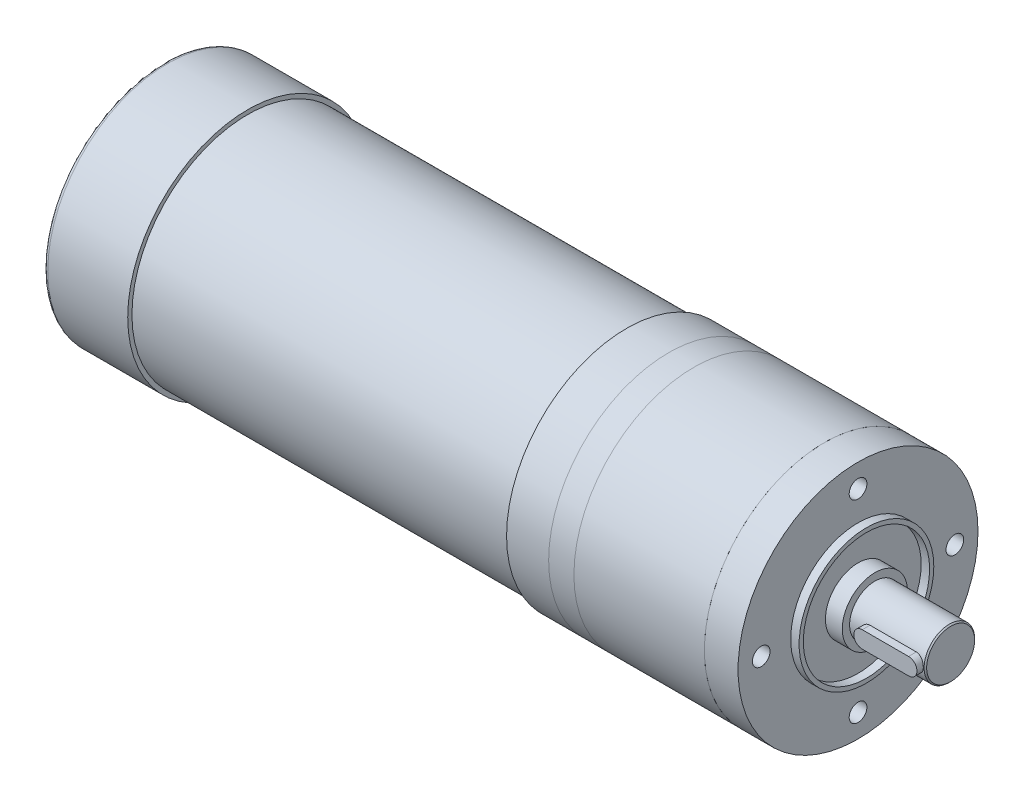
ISO-10303-21;
HEADER;
FILE_DESCRIPTION(('STEP AP214'),'2;1');
FILE_NAME('part.step','',(''),(''),'','','');
FILE_SCHEMA(('AUTOMOTIVE_DESIGN { 1 0 10303 214 1 1 1 1 }'));
ENDSEC;
DATA;
#1=APPLICATION_CONTEXT('core data for automotive mechanical design processes');
#2=APPLICATION_PROTOCOL_DEFINITION('international standard','automotive_design',2000,#1);
#3=PRODUCT_CONTEXT('',#1,'mechanical');
#4=PRODUCT('Part','Part','',(#3));
#5=PRODUCT_RELATED_PRODUCT_CATEGORY('part','',(#4));
#6=PRODUCT_DEFINITION_FORMATION('','',#4);
#7=PRODUCT_DEFINITION_CONTEXT('part definition',#1,'design');
#8=PRODUCT_DEFINITION('design','',#6,#7);
#9=PRODUCT_DEFINITION_SHAPE('','',#8);
#10=(LENGTH_UNIT() NAMED_UNIT(*) SI_UNIT(.MILLI.,.METRE.));
#11=(NAMED_UNIT(*) PLANE_ANGLE_UNIT() SI_UNIT($,.RADIAN.));
#12=(NAMED_UNIT(*) SI_UNIT($,.STERADIAN.) SOLID_ANGLE_UNIT());
#13=UNCERTAINTY_MEASURE_WITH_UNIT(LENGTH_MEASURE(1.E-05),#10,'distance_accuracy_value','');
#14=(GEOMETRIC_REPRESENTATION_CONTEXT(3) GLOBAL_UNCERTAINTY_ASSIGNED_CONTEXT((#13)) GLOBAL_UNIT_ASSIGNED_CONTEXT((#10,
#11,#12)) REPRESENTATION_CONTEXT('',''));
#15=CARTESIAN_POINT('',(0.,0.,0.));
#16=DIRECTION('',(0.,0.,1.));
#17=DIRECTION('',(1.,0.,0.));
#18=AXIS2_PLACEMENT_3D('',#15,#16,#17);
#19=CARTESIAN_POINT('',(8.5,0.,7.5));
#20=DIRECTION('',(0.,0.,-1.));
#21=DIRECTION('',(-1.,0.,0.));
#22=AXIS2_PLACEMENT_3D('',#19,#20,#21);
#23=CYLINDRICAL_SURFACE('',#22,2.);
#24=CARTESIAN_POINT('',(8.5,0.,3.5));
#25=DIRECTION('',(0.,0.,1.));
#26=DIRECTION('',(1.,0.,0.));
#27=AXIS2_PLACEMENT_3D('',#24,#25,#26);
#28=CIRCLE('',#27,2.);
#29=CARTESIAN_POINT('',(8.5,2.,3.5));
#30=VERTEX_POINT('',#29);
#31=CARTESIAN_POINT('',(8.5,-2.,3.5));
#32=VERTEX_POINT('',#31);
#33=EDGE_CURVE('E111',#30,#32,#28,.T.);
#34=ORIENTED_EDGE('',*,*,#33,.T.);
#35=DIRECTION('',(0.,0.,-1.));
#36=VECTOR('',#35,1.);
#37=CARTESIAN_POINT('',(8.5,-2.,7.5));
#38=LINE('',#37,#36);
#39=CARTESIAN_POINT('',(8.5,-2.,7.5));
#40=VERTEX_POINT('',#39);
#41=EDGE_CURVE('E12',#40,#32,#38,.T.);
#42=ORIENTED_EDGE('',*,*,#41,.F.);
#43=CARTESIAN_POINT('',(8.5,0.,7.5));
#44=DIRECTION('',(0.,0.,1.));
#45=DIRECTION('',(1.,0.,0.));
#46=AXIS2_PLACEMENT_3D('',#43,#44,#45);
#47=CIRCLE('',#46,2.);
#48=CARTESIAN_POINT('',(8.5,2.,7.5));
#49=VERTEX_POINT('',#48);
#50=EDGE_CURVE('E99',#49,#40,#47,.T.);
#51=ORIENTED_EDGE('',*,*,#50,.F.);
#52=DIRECTION('',(0.,0.,-1.));
#53=VECTOR('',#52,1.);
#54=CARTESIAN_POINT('',(8.5,2.,7.5));
#55=LINE('',#54,#53);
#56=EDGE_CURVE('E107',#49,#30,#55,.T.);
#57=ORIENTED_EDGE('',*,*,#56,.T.);
#58=EDGE_LOOP('',(#34,#42,#51,#57));
#59=FACE_BOUND('',#58,.T.);
#60=ADVANCED_FACE('F48',(#59),#23,.T.);
#61=CARTESIAN_POINT('',(19.5,-2.,7.5));
#62=DIRECTION('',(0.,1.,0.));
#63=DIRECTION('',(-1.,0.,0.));
#64=AXIS2_PLACEMENT_3D('',#61,#62,#63);
#65=PLANE('',#64);
#66=DIRECTION('',(1.,0.,0.));
#67=VECTOR('',#66,1.);
#68=CARTESIAN_POINT('',(19.5,-2.,3.5));
#69=LINE('',#68,#67);
#70=CARTESIAN_POINT('',(19.5,-2.,3.5));
#71=VERTEX_POINT('',#70);
#72=EDGE_CURVE('E103',#32,#71,#69,.T.);
#73=ORIENTED_EDGE('',*,*,#72,.T.);
#74=DIRECTION('',(0.,0.,-1.));
#75=VECTOR('',#74,1.);
#76=CARTESIAN_POINT('',(19.5,-2.,7.5));
#77=LINE('',#76,#75);
#78=CARTESIAN_POINT('',(19.5,-2.,7.5));
#79=VERTEX_POINT('',#78);
#80=EDGE_CURVE('E56',#79,#71,#77,.T.);
#81=ORIENTED_EDGE('',*,*,#80,.F.);
#82=DIRECTION('',(1.,0.,0.));
#83=VECTOR('',#82,1.);
#84=CARTESIAN_POINT('',(19.5,-2.,7.5));
#85=LINE('',#84,#83);
#86=EDGE_CURVE('E94',#40,#79,#85,.T.);
#87=ORIENTED_EDGE('',*,*,#86,.F.);
#88=ORIENTED_EDGE('',*,*,#41,.T.);
#89=EDGE_LOOP('',(#73,#81,#87,#88));
#90=FACE_BOUND('',#89,.T.);
#91=ADVANCED_FACE('F102',(#90),#65,.F.);
#92=CARTESIAN_POINT('',(19.5,0.,7.5));
#93=DIRECTION('',(0.,0.,-1.));
#94=DIRECTION('',(-1.,0.,0.));
#95=AXIS2_PLACEMENT_3D('',#92,#93,#94);
#96=CYLINDRICAL_SURFACE('',#95,2.);
#97=CARTESIAN_POINT('',(19.5,0.,3.5));
#98=DIRECTION('',(0.,0.,1.));
#99=DIRECTION('',(1.,0.,0.));
#100=AXIS2_PLACEMENT_3D('',#97,#98,#99);
#101=CIRCLE('',#100,2.);
#102=CARTESIAN_POINT('',(19.5,2.,3.5));
#103=VERTEX_POINT('',#102);
#104=EDGE_CURVE('E81',#71,#103,#101,.T.);
#105=ORIENTED_EDGE('',*,*,#104,.T.);
#106=DIRECTION('',(0.,0.,-1.));
#107=VECTOR('',#106,1.);
#108=CARTESIAN_POINT('',(19.5,2.,7.5));
#109=LINE('',#108,#107);
#110=CARTESIAN_POINT('',(19.5,2.,7.5));
#111=VERTEX_POINT('',#110);
#112=EDGE_CURVE('E104',#111,#103,#109,.T.);
#113=ORIENTED_EDGE('',*,*,#112,.F.);
#114=CARTESIAN_POINT('',(19.5,0.,7.5));
#115=DIRECTION('',(0.,0.,1.));
#116=DIRECTION('',(1.,0.,0.));
#117=AXIS2_PLACEMENT_3D('',#114,#115,#116);
#118=CIRCLE('',#117,2.);
#119=EDGE_CURVE('E97',#79,#111,#118,.T.);
#120=ORIENTED_EDGE('',*,*,#119,.F.);
#121=ORIENTED_EDGE('',*,*,#80,.T.);
#122=EDGE_LOOP('',(#105,#113,#120,#121));
#123=FACE_BOUND('',#122,.T.);
#124=ADVANCED_FACE('F105',(#123),#96,.T.);
#125=CARTESIAN_POINT('',(8.5,2.,7.5));
#126=DIRECTION('',(0.,-1.,0.));
#127=DIRECTION('',(1.,0.,0.));
#128=AXIS2_PLACEMENT_3D('',#125,#126,#127);
#129=PLANE('',#128);
#130=DIRECTION('',(-1.,0.,0.));
#131=VECTOR('',#130,1.);
#132=CARTESIAN_POINT('',(8.5,2.,3.5));
#133=LINE('',#132,#131);
#134=EDGE_CURVE('E87',#103,#30,#133,.T.);
#135=ORIENTED_EDGE('',*,*,#134,.T.);
#136=ORIENTED_EDGE('',*,*,#56,.F.);
#137=DIRECTION('',(-1.,0.,0.));
#138=VECTOR('',#137,1.);
#139=CARTESIAN_POINT('',(8.5,2.,7.5));
#140=LINE('',#139,#138);
#141=EDGE_CURVE('E64',#111,#49,#140,.T.);
#142=ORIENTED_EDGE('',*,*,#141,.F.);
#143=ORIENTED_EDGE('',*,*,#112,.T.);
#144=EDGE_LOOP('',(#135,#136,#142,#143));
#145=FACE_BOUND('',#144,.T.);
#146=ADVANCED_FACE('F118',(#145),#129,.F.);
#147=CARTESIAN_POINT('',(8.5,0.,7.5));
#148=DIRECTION('',(0.,0.,1.));
#149=DIRECTION('',(1.,0.,0.));
#150=AXIS2_PLACEMENT_3D('',#147,#148,#149);
#151=PLANE('',#150);
#152=ORIENTED_EDGE('',*,*,#50,.T.);
#153=ORIENTED_EDGE('',*,*,#86,.T.);
#154=ORIENTED_EDGE('',*,*,#119,.T.);
#155=ORIENTED_EDGE('',*,*,#141,.T.);
#156=EDGE_LOOP('',(#152,#153,#154,#155));
#157=FACE_BOUND('',#156,.T.);
#158=ADVANCED_FACE('F95',(#157),#151,.T.);
#159=CARTESIAN_POINT('',(8.5,0.,3.5));
#160=DIRECTION('',(0.,0.,1.));
#161=DIRECTION('',(1.,0.,0.));
#162=AXIS2_PLACEMENT_3D('',#159,#160,#161);
#163=PLANE('',#162);
#164=ORIENTED_EDGE('',*,*,#33,.F.);
#165=ORIENTED_EDGE('',*,*,#134,.F.);
#166=ORIENTED_EDGE('',*,*,#104,.F.);
#167=ORIENTED_EDGE('',*,*,#72,.F.);
#168=EDGE_LOOP('',(#164,#165,#166,#167));
#169=FACE_BOUND('',#168,.T.);
#170=ADVANCED_FACE('F121',(#169),#163,.F.);
#171=CLOSED_SHELL('',(#60,#91,#124,#146,#158,#170));
#172=MANIFOLD_SOLID_BREP('B2',#171);
#173=CARTESIAN_POINT('',(-55.,0.,0.));
#174=DIRECTION('',(-1.,0.,0.));
#175=DIRECTION('',(0.,0.,1.));
#176=AXIS2_PLACEMENT_3D('',#173,#174,#175);
#177=PLANE('',#176);
#178=CARTESIAN_POINT('',(-55.,0.,0.));
#179=DIRECTION('',(-1.,0.,0.));
#180=DIRECTION('',(0.,0.,1.));
#181=AXIS2_PLACEMENT_3D('',#178,#179,#180);
#182=CIRCLE('',#181,28.5);
#183=CARTESIAN_POINT('',(-55.,0.,28.5));
#184=VERTEX_POINT('',#183);
#185=EDGE_CURVE('E191',#184,#184,#182,.T.);
#186=ORIENTED_EDGE('',*,*,#185,.T.);
#187=EDGE_LOOP('',(#186));
#188=FACE_BOUND('',#187,.T.);
#189=CARTESIAN_POINT('',(-55.,0.,0.));
#190=DIRECTION('',(-1.,0.,0.));
#191=DIRECTION('',(0.,0.,1.));
#192=AXIS2_PLACEMENT_3D('',#189,#190,#191);
#193=CIRCLE('',#192,27.5);
#194=CARTESIAN_POINT('',(-55.,0.,-27.5));
#195=VERTEX_POINT('',#194);
#196=EDGE_CURVE('E201',#195,#195,#193,.T.);
#197=ORIENTED_EDGE('',*,*,#196,.F.);
#198=EDGE_LOOP('',(#197));
#199=FACE_BOUND('',#198,.T.);
#200=ADVANCED_FACE('F180',(#188,#199),#177,.T.);
#201=CARTESIAN_POINT('',(-55.,0.,0.));
#202=DIRECTION('',(1.,0.,0.));
#203=DIRECTION('',(0.,0.,-1.));
#204=AXIS2_PLACEMENT_3D('',#201,#202,#203);
#205=CYLINDRICAL_SURFACE('',#204,28.5);
#206=ORIENTED_EDGE('',*,*,#185,.F.);
#207=EDGE_LOOP('',(#206));
#208=FACE_BOUND('',#207,.T.);
#209=CARTESIAN_POINT('',(-45.,0.,0.));
#210=DIRECTION('',(-1.,0.,0.));
#211=DIRECTION('',(0.,0.,1.));
#212=AXIS2_PLACEMENT_3D('',#209,#210,#211);
#213=CIRCLE('',#212,28.5);
#214=CARTESIAN_POINT('',(-45.,0.,28.5));
#215=VERTEX_POINT('',#214);
#216=EDGE_CURVE('E195',#215,#215,#213,.T.);
#217=ORIENTED_EDGE('',*,*,#216,.T.);
#218=EDGE_LOOP('',(#217));
#219=FACE_BOUND('',#218,.T.);
#220=ADVANCED_FACE('F226',(#208,#219),#205,.T.);
#221=CARTESIAN_POINT('',(-45.,0.,0.));
#222=DIRECTION('',(-1.,0.,0.));
#223=DIRECTION('',(0.,0.,1.));
#224=AXIS2_PLACEMENT_3D('',#221,#222,#223);
#225=PLANE('',#224);
#226=ORIENTED_EDGE('',*,*,#216,.F.);
#227=EDGE_LOOP('',(#226));
#228=FACE_BOUND('',#227,.T.);
#229=ADVANCED_FACE('F221',(#228),#225,.F.);
#230=CARTESIAN_POINT('',(-145.,0.,0.));
#231=DIRECTION('',(1.,0.,0.));
#232=DIRECTION('',(0.,0.,-1.));
#233=AXIS2_PLACEMENT_3D('',#230,#231,#232);
#234=CYLINDRICAL_SURFACE('',#233,27.5);
#235=CARTESIAN_POINT('',(-145.,0.,0.));
#236=DIRECTION('',(-1.,0.,0.));
#237=DIRECTION('',(0.,0.,1.));
#238=AXIS2_PLACEMENT_3D('',#235,#236,#237);
#239=CIRCLE('',#238,27.5);
#240=CARTESIAN_POINT('',(-145.,0.,-27.5));
#241=VERTEX_POINT('',#240);
#242=EDGE_CURVE('E199',#241,#241,#239,.T.);
#243=CARTESIAN_POINT('',(-145.,0.,-27.5));
#244=CARTESIAN_POINT('',(-144.0625,0.,-27.5));
#245=CARTESIAN_POINT('',(-143.125,0.,-27.5));
#246=CARTESIAN_POINT('',(-141.25,0.,-27.5));
#247=CARTESIAN_POINT('',(-140.3125,0.,-27.5));
#248=CARTESIAN_POINT('',(-138.4375,0.,-27.5));
#249=CARTESIAN_POINT('',(-137.5,0.,-27.5));
#250=CARTESIAN_POINT('',(-135.625,0.,-27.5));
#251=CARTESIAN_POINT('',(-134.6875,0.,-27.5));
#252=CARTESIAN_POINT('',(-132.8125,0.,-27.5));
#253=CARTESIAN_POINT('',(-131.875,0.,-27.5));
#254=CARTESIAN_POINT('',(-130.,0.,-27.5));
#255=CARTESIAN_POINT('',(-129.0625,0.,-27.5));
#256=CARTESIAN_POINT('',(-127.1875,0.,-27.5));
#257=CARTESIAN_POINT('',(-126.25,0.,-27.5));
#258=CARTESIAN_POINT('',(-124.375,0.,-27.5));
#259=CARTESIAN_POINT('',(-123.4375,0.,-27.5));
#260=CARTESIAN_POINT('',(-121.5625,0.,-27.5));
#261=CARTESIAN_POINT('',(-120.625,0.,-27.5));
#262=CARTESIAN_POINT('',(-118.75,0.,-27.5));
#263=CARTESIAN_POINT('',(-117.8125,0.,-27.5));
#264=CARTESIAN_POINT('',(-115.9375,0.,-27.5));
#265=CARTESIAN_POINT('',(-115.,0.,-27.5));
#266=CARTESIAN_POINT('',(-113.125,0.,-27.5));
#267=CARTESIAN_POINT('',(-112.1875,0.,-27.5));
#268=CARTESIAN_POINT('',(-110.3125,0.,-27.5));
#269=CARTESIAN_POINT('',(-109.375,0.,-27.5));
#270=CARTESIAN_POINT('',(-107.5,0.,-27.5));
#271=CARTESIAN_POINT('',(-106.5625,0.,-27.5));
#272=CARTESIAN_POINT('',(-104.6875,0.,-27.5));
#273=CARTESIAN_POINT('',(-103.75,0.,-27.5));
#274=CARTESIAN_POINT('',(-101.875,0.,-27.5));
#275=CARTESIAN_POINT('',(-100.9375,0.,-27.5));
#276=CARTESIAN_POINT('',(-99.0625,0.,-27.5));
#277=CARTESIAN_POINT('',(-98.125,0.,-27.5));
#278=CARTESIAN_POINT('',(-96.25,0.,-27.5));
#279=CARTESIAN_POINT('',(-95.3125,0.,-27.5));
#280=CARTESIAN_POINT('',(-93.4375,0.,-27.5));
#281=CARTESIAN_POINT('',(-92.5,0.,-27.5));
#282=CARTESIAN_POINT('',(-90.625,0.,-27.5));
#283=CARTESIAN_POINT('',(-89.6875,0.,-27.5));
#284=CARTESIAN_POINT('',(-87.8125,0.,-27.5));
#285=CARTESIAN_POINT('',(-86.875,0.,-27.5));
#286=CARTESIAN_POINT('',(-85.,0.,-27.5));
#287=CARTESIAN_POINT('',(-84.0625,0.,-27.5));
#288=CARTESIAN_POINT('',(-82.1875,0.,-27.5));
#289=CARTESIAN_POINT('',(-81.25,0.,-27.5));
#290=CARTESIAN_POINT('',(-79.375,0.,-27.5));
#291=CARTESIAN_POINT('',(-78.4375,0.,-27.5));
#292=CARTESIAN_POINT('',(-76.5625,0.,-27.5));
#293=CARTESIAN_POINT('',(-75.625,0.,-27.5));
#294=CARTESIAN_POINT('',(-73.75,0.,-27.5));
#295=CARTESIAN_POINT('',(-72.8125,0.,-27.5));
#296=CARTESIAN_POINT('',(-70.9375,0.,-27.5));
#297=CARTESIAN_POINT('',(-70.,0.,-27.5));
#298=CARTESIAN_POINT('',(-68.125,0.,-27.5));
#299=CARTESIAN_POINT('',(-67.1875,0.,-27.5));
#300=CARTESIAN_POINT('',(-65.3125,0.,-27.5));
#301=CARTESIAN_POINT('',(-64.375,0.,-27.5));
#302=CARTESIAN_POINT('',(-62.5,0.,-27.5));
#303=CARTESIAN_POINT('',(-61.5625,0.,-27.5));
#304=CARTESIAN_POINT('',(-59.6875,0.,-27.5));
#305=CARTESIAN_POINT('',(-58.75,0.,-27.5));
#306=CARTESIAN_POINT('',(-56.875,0.,-27.5));
#307=CARTESIAN_POINT('',(-55.9375,0.,-27.5));
#308=CARTESIAN_POINT('',(-55.,0.,-27.5));
#309=B_SPLINE_CURVE_WITH_KNOTS('',3,(#243,#244,#245,#246,#247,#248,#249,#250,#251,#252,#253,
#254,#255,#256,#257,#258,#259,#260,#261,#262,#263,#264,#265,#266,#267,#268,#269,#270,#271,#272,
#273,#274,#275,#276,#277,#278,#279,#280,#281,#282,#283,#284,#285,#286,#287,#288,#289,#290,#291,
#292,#293,#294,#295,#296,#297,#298,#299,#300,#301,#302,#303,#304,#305,#306,#307,#308),
.UNSPECIFIED.,.F.,.F.,(4,2,2,2,2,2,2,2,2,2,2,2,2,2,2,2,2,2,2,2,2,2,2,2,2,2,2,2,2,2,2,2,4),(0.,
2.8125,5.62499999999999,8.43749999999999,11.25,14.0625,16.875,19.6875,22.5,25.3125,28.125,
30.9375,33.75,36.5625,39.375,42.1875,45.,47.8125,50.625,53.4375,56.25,59.0625,61.875,64.6875,
67.5,70.3125,73.125,75.9375,78.75,81.5625,84.3749999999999,87.1875,90.),.UNSPECIFIED.);
#310=EDGE_CURVE('BSEAM215',#241,#195,#309,.T.);
#311=ORIENTED_EDGE('',*,*,#242,.F.);
#312=ORIENTED_EDGE('',*,*,#196,.T.);
#313=ORIENTED_EDGE('',*,*,#310,.T.);
#314=ORIENTED_EDGE('',*,*,#310,.F.);
#315=EDGE_LOOP('',(#311,#313,#312,#314));
#316=FACE_BOUND('',#315,.T.);
#317=ADVANCED_FACE('F215',(#316),#234,.T.);
#318=CARTESIAN_POINT('',(-145.,0.,0.));
#319=DIRECTION('',(-1.,0.,0.));
#320=DIRECTION('',(0.,0.,1.));
#321=AXIS2_PLACEMENT_3D('',#318,#319,#320);
#322=PLANE('',#321);
#323=CARTESIAN_POINT('',(-145.,0.,0.));
#324=DIRECTION('',(-1.,0.,0.));
#325=DIRECTION('',(0.,0.,1.));
#326=AXIS2_PLACEMENT_3D('',#323,#324,#325);
#327=CIRCLE('',#326,28.5);
#328=CARTESIAN_POINT('',(-145.,0.,28.5));
#329=VERTEX_POINT('',#328);
#330=EDGE_CURVE('E204',#329,#329,#327,.T.);
#331=ORIENTED_EDGE('',*,*,#330,.F.);
#332=EDGE_LOOP('',(#331));
#333=FACE_BOUND('',#332,.T.);
#334=ORIENTED_EDGE('',*,*,#242,.T.);
#335=EDGE_LOOP('',(#334));
#336=FACE_BOUND('',#335,.T.);
#337=ADVANCED_FACE('F212',(#333,#336),#322,.F.);
#338=CARTESIAN_POINT('',(-165.,0.,0.));
#339=DIRECTION('',(1.,0.,0.));
#340=DIRECTION('',(0.,0.,-1.));
#341=AXIS2_PLACEMENT_3D('',#338,#339,#340);
#342=CYLINDRICAL_SURFACE('',#341,28.5);
#343=CARTESIAN_POINT('',(-164.,0.,0.));
#344=DIRECTION('',(-1.,0.,0.));
#345=DIRECTION('',(0.,0.,1.));
#346=AXIS2_PLACEMENT_3D('',#343,#344,#345);
#347=CIRCLE('',#346,28.5);
#348=CARTESIAN_POINT('',(-164.,0.,28.5));
#349=VERTEX_POINT('',#348);
#350=EDGE_CURVE('E47',#349,#349,#347,.F.);
#351=ORIENTED_EDGE('',*,*,#350,.T.);
#352=EDGE_LOOP('',(#351));
#353=FACE_BOUND('',#352,.T.);
#354=ORIENTED_EDGE('',*,*,#330,.T.);
#355=EDGE_LOOP('',(#354));
#356=FACE_BOUND('',#355,.T.);
#357=ADVANCED_FACE('F210',(#353,#356),#342,.T.);
#358=CARTESIAN_POINT('',(-165.,0.,0.));
#359=DIRECTION('',(-1.,0.,0.));
#360=DIRECTION('',(0.,0.,1.));
#361=AXIS2_PLACEMENT_3D('',#358,#359,#360);
#362=PLANE('',#361);
#363=CARTESIAN_POINT('',(-165.,0.,0.));
#364=DIRECTION('',(-1.,0.,0.));
#365=DIRECTION('',(0.,0.,1.));
#366=AXIS2_PLACEMENT_3D('',#363,#364,#365);
#367=CIRCLE('',#366,27.5);
#368=CARTESIAN_POINT('',(-165.,0.,27.5));
#369=VERTEX_POINT('',#368);
#370=EDGE_CURVE('E187',#369,#369,#367,.T.);
#371=ORIENTED_EDGE('',*,*,#370,.T.);
#372=EDGE_LOOP('',(#371));
#373=FACE_BOUND('',#372,.T.);
#374=ADVANCED_FACE('F257',(#373),#362,.T.);
#375=CARTESIAN_POINT('',(-164.,0.,0.));
#376=DIRECTION('',(-1.,0.,0.));
#377=DIRECTION('',(0.,0.,1.));
#378=AXIS2_PLACEMENT_3D('',#375,#376,#377);
#379=TOROIDAL_SURFACE('',#378,27.5,1.);
#380=ORIENTED_EDGE('',*,*,#350,.F.);
#381=EDGE_LOOP('',(#380));
#382=FACE_BOUND('',#381,.T.);
#383=ORIENTED_EDGE('',*,*,#370,.F.);
#384=EDGE_LOOP('',(#383));
#385=FACE_BOUND('',#384,.T.);
#386=ADVANCED_FACE('F182',(#382,#385),#379,.T.);
#387=CLOSED_SHELL('',(#200,#220,#229,#317,#337,#357,#374,#386));
#388=MANIFOLD_SOLID_BREP('B6',#387);
#389=CARTESIAN_POINT('',(-45.,0.,0.));
#390=DIRECTION('',(1.,0.,0.));
#391=DIRECTION('',(0.,0.,-1.));
#392=AXIS2_PLACEMENT_3D('',#389,#390,#391);
#393=CYLINDRICAL_SURFACE('',#392,28.5);
#394=CARTESIAN_POINT('',(-45.,0.,0.));
#395=DIRECTION('',(-1.,0.,0.));
#396=DIRECTION('',(0.,0.,1.));
#397=AXIS2_PLACEMENT_3D('',#394,#395,#396);
#398=CIRCLE('',#397,28.5);
#399=CARTESIAN_POINT('',(-45.,0.,28.5));
#400=VERTEX_POINT('',#399);
#401=EDGE_CURVE('E179',#400,#400,#398,.T.);
#402=ORIENTED_EDGE('',*,*,#401,.F.);
#403=EDGE_LOOP('',(#402));
#404=FACE_BOUND('',#403,.T.);
#405=CARTESIAN_POINT('',(-39.,0.,0.));
#406=DIRECTION('',(-1.,0.,0.));
#407=DIRECTION('',(0.,0.,1.));
#408=AXIS2_PLACEMENT_3D('',#405,#406,#407);
#409=CIRCLE('',#408,28.5);
#410=CARTESIAN_POINT('',(-39.,0.,28.5));
#411=VERTEX_POINT('',#410);
#412=EDGE_CURVE('E309',#411,#411,#409,.T.);
#413=ORIENTED_EDGE('',*,*,#412,.T.);
#414=EDGE_LOOP('',(#413));
#415=FACE_BOUND('',#414,.T.);
#416=ADVANCED_FACE('F306',(#404,#415),#393,.T.);
#417=CARTESIAN_POINT('',(-45.,0.,0.));
#418=DIRECTION('',(-1.,0.,0.));
#419=DIRECTION('',(0.,0.,1.));
#420=AXIS2_PLACEMENT_3D('',#417,#418,#419);
#421=PLANE('',#420);
#422=ORIENTED_EDGE('',*,*,#401,.T.);
#423=EDGE_LOOP('',(#422));
#424=FACE_BOUND('',#423,.T.);
#425=ADVANCED_FACE('F321',(#424),#421,.T.);
#426=CARTESIAN_POINT('',(-39.,0.,0.));
#427=DIRECTION('',(-1.,0.,0.));
#428=DIRECTION('',(0.,0.,1.));
#429=AXIS2_PLACEMENT_3D('',#426,#427,#428);
#430=PLANE('',#429);
#431=ORIENTED_EDGE('',*,*,#412,.F.);
#432=EDGE_LOOP('',(#431));
#433=FACE_BOUND('',#432,.T.);
#434=ADVANCED_FACE('F319',(#433),#430,.F.);
#435=CLOSED_SHELL('',(#416,#425,#434));
#436=MANIFOLD_SOLID_BREP('B42',#435);
#437=CARTESIAN_POINT('',(-39.,0.,0.));
#438=DIRECTION('',(1.,0.,0.));
#439=DIRECTION('',(0.,0.,-1.));
#440=AXIS2_PLACEMENT_3D('',#437,#438,#439);
#441=CYLINDRICAL_SURFACE('',#440,28.5);
#442=CARTESIAN_POINT('',(-39.,0.,0.));
#443=DIRECTION('',(-1.,0.,0.));
#444=DIRECTION('',(0.,0.,1.));
#445=AXIS2_PLACEMENT_3D('',#442,#443,#444);
#446=CIRCLE('',#445,28.5);
#447=CARTESIAN_POINT('',(-39.,0.,28.5));
#448=VERTEX_POINT('',#447);
#449=EDGE_CURVE('E304',#448,#448,#446,.T.);
#450=ORIENTED_EDGE('',*,*,#449,.F.);
#451=EDGE_LOOP('',(#450));
#452=FACE_BOUND('',#451,.T.);
#453=CARTESIAN_POINT('',(-8.,0.,0.));
#454=DIRECTION('',(-1.,0.,0.));
#455=DIRECTION('',(0.,0.,1.));
#456=AXIS2_PLACEMENT_3D('',#453,#454,#455);
#457=CIRCLE('',#456,28.5);
#458=CARTESIAN_POINT('',(-8.,0.,28.5));
#459=VERTEX_POINT('',#458);
#460=EDGE_CURVE('E364',#459,#459,#457,.T.);
#461=ORIENTED_EDGE('',*,*,#460,.T.);
#462=EDGE_LOOP('',(#461));
#463=FACE_BOUND('',#462,.T.);
#464=ADVANCED_FACE('F356',(#452,#463),#441,.T.);
#465=CARTESIAN_POINT('',(-39.,0.,0.));
#466=DIRECTION('',(-1.,0.,0.));
#467=DIRECTION('',(0.,0.,1.));
#468=AXIS2_PLACEMENT_3D('',#465,#466,#467);
#469=PLANE('',#468);
#470=ORIENTED_EDGE('',*,*,#449,.T.);
#471=EDGE_LOOP('',(#470));
#472=FACE_BOUND('',#471,.T.);
#473=ADVANCED_FACE('F429',(#472),#469,.T.);
#474=CARTESIAN_POINT('',(-8.,0.,0.));
#475=DIRECTION('',(-1.,0.,0.));
#476=DIRECTION('',(0.,0.,1.));
#477=AXIS2_PLACEMENT_3D('',#474,#475,#476);
#478=PLANE('',#477);
#479=CARTESIAN_POINT('',(-8.,23.,0.));
#480=DIRECTION('',(-1.,0.,0.));
#481=DIRECTION('',(0.,0.,1.));
#482=AXIS2_PLACEMENT_3D('',#479,#480,#481);
#483=CIRCLE('',#482,2.1);
#484=CARTESIAN_POINT('',(-8.,23.,2.1));
#485=VERTEX_POINT('',#484);
#486=EDGE_CURVE('E359',#485,#485,#483,.T.);
#487=ORIENTED_EDGE('',*,*,#486,.T.);
#488=EDGE_LOOP('',(#487));
#489=FACE_BOUND('',#488,.T.);
#490=CARTESIAN_POINT('',(-8.,0.,-23.));
#491=DIRECTION('',(-1.,0.,0.));
#492=DIRECTION('',(0.,0.,1.));
#493=AXIS2_PLACEMENT_3D('',#490,#491,#492);
#494=CIRCLE('',#493,2.1);
#495=CARTESIAN_POINT('',(-8.,0.,-20.9));
#496=VERTEX_POINT('',#495);
#497=EDGE_CURVE('E393',#496,#496,#494,.T.);
#498=ORIENTED_EDGE('',*,*,#497,.T.);
#499=EDGE_LOOP('',(#498));
#500=FACE_BOUND('',#499,.T.);
#501=CARTESIAN_POINT('',(-8.,-23.,0.));
#502=DIRECTION('',(-1.,0.,0.));
#503=DIRECTION('',(0.,0.,1.));
#504=AXIS2_PLACEMENT_3D('',#501,#502,#503);
#505=CIRCLE('',#504,2.1);
#506=CARTESIAN_POINT('',(-8.,-23.,2.1));
#507=VERTEX_POINT('',#506);
#508=EDGE_CURVE('E397',#507,#507,#505,.T.);
#509=ORIENTED_EDGE('',*,*,#508,.T.);
#510=EDGE_LOOP('',(#509));
#511=FACE_BOUND('',#510,.T.);
#512=CARTESIAN_POINT('',(-8.,0.,23.));
#513=DIRECTION('',(-1.,0.,0.));
#514=DIRECTION('',(0.,0.,1.));
#515=AXIS2_PLACEMENT_3D('',#512,#513,#514);
#516=CIRCLE('',#515,2.1);
#517=CARTESIAN_POINT('',(-8.,0.,25.1));
#518=VERTEX_POINT('',#517);
#519=EDGE_CURVE('E400',#518,#518,#516,.T.);
#520=ORIENTED_EDGE('',*,*,#519,.T.);
#521=EDGE_LOOP('',(#520));
#522=FACE_BOUND('',#521,.T.);
#523=ORIENTED_EDGE('',*,*,#460,.F.);
#524=EDGE_LOOP('',(#523));
#525=FACE_BOUND('',#524,.T.);
#526=ADVANCED_FACE('F410',(#489,#500,#511,#522,#525),#478,.F.);
#527=CARTESIAN_POINT('',(0.,0.,23.));
#528=DIRECTION('',(1.,0.,0.));
#529=DIRECTION('',(0.,0.,-1.));
#530=AXIS2_PLACEMENT_3D('',#527,#528,#529);
#531=CYLINDRICAL_SURFACE('',#530,2.1);
#532=CARTESIAN_POINT('',(-14.,0.,23.));
#533=DIRECTION('',(1.,0.,0.));
#534=DIRECTION('',(0.,0.,-1.));
#535=AXIS2_PLACEMENT_3D('',#532,#533,#534);
#536=CIRCLE('',#535,2.1);
#537=CARTESIAN_POINT('',(-14.,0.,20.9));
#538=VERTEX_POINT('',#537);
#539=EDGE_CURVE('E398',#538,#538,#536,.T.);
#540=ORIENTED_EDGE('',*,*,#539,.F.);
#541=EDGE_LOOP('',(#540));
#542=FACE_BOUND('',#541,.T.);
#543=ORIENTED_EDGE('',*,*,#519,.F.);
#544=EDGE_LOOP('',(#543));
#545=FACE_BOUND('',#544,.T.);
#546=ADVANCED_FACE('F441',(#542,#545),#531,.F.);
#547=CARTESIAN_POINT('',(-14.,0.,23.));
#548=DIRECTION('',(1.,0.,0.));
#549=DIRECTION('',(0.,0.,-1.));
#550=AXIS2_PLACEMENT_3D('',#547,#548,#549);
#551=CONICAL_SURFACE('',#550,2.1,1.02974425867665);
#552=CARTESIAN_POINT('',(-15.2618072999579,0.,23.));
#553=VERTEX_POINT('',#552);
#554=VERTEX_LOOP('',#553);
#555=FACE_BOUND('',#554,.T.);
#556=ORIENTED_EDGE('',*,*,#539,.T.);
#557=EDGE_LOOP('',(#556));
#558=FACE_BOUND('',#557,.T.);
#559=ADVANCED_FACE('F446',(#555,#558),#551,.F.);
#560=CARTESIAN_POINT('',(0.,-23.,0.));
#561=DIRECTION('',(1.,0.,0.));
#562=DIRECTION('',(0.,0.,-1.));
#563=AXIS2_PLACEMENT_3D('',#560,#561,#562);
#564=CYLINDRICAL_SURFACE('',#563,2.1);
#565=CARTESIAN_POINT('',(-14.,-23.,0.));
#566=DIRECTION('',(1.,0.,0.));
#567=DIRECTION('',(0.,0.,-1.));
#568=AXIS2_PLACEMENT_3D('',#565,#566,#567);
#569=CIRCLE('',#568,2.1);
#570=CARTESIAN_POINT('',(-14.,-23.,-2.1));
#571=VERTEX_POINT('',#570);
#572=EDGE_CURVE('E394',#571,#571,#569,.T.);
#573=ORIENTED_EDGE('',*,*,#572,.F.);
#574=EDGE_LOOP('',(#573));
#575=FACE_BOUND('',#574,.T.);
#576=ORIENTED_EDGE('',*,*,#508,.F.);
#577=EDGE_LOOP('',(#576));
#578=FACE_BOUND('',#577,.T.);
#579=ADVANCED_FACE('F425',(#575,#578),#564,.F.);
#580=CARTESIAN_POINT('',(-14.,-23.,0.));
#581=DIRECTION('',(1.,0.,0.));
#582=DIRECTION('',(0.,0.,-1.));
#583=AXIS2_PLACEMENT_3D('',#580,#581,#582);
#584=CONICAL_SURFACE('',#583,2.1,1.02974425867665);
#585=CARTESIAN_POINT('',(-15.2618072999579,-23.,0.));
#586=VERTEX_POINT('',#585);
#587=VERTEX_LOOP('',#586);
#588=FACE_BOUND('',#587,.T.);
#589=ORIENTED_EDGE('',*,*,#572,.T.);
#590=EDGE_LOOP('',(#589));
#591=FACE_BOUND('',#590,.T.);
#592=ADVANCED_FACE('F416',(#588,#591),#584,.F.);
#593=CARTESIAN_POINT('',(0.,0.,-23.));
#594=DIRECTION('',(1.,0.,0.));
#595=DIRECTION('',(0.,0.,-1.));
#596=AXIS2_PLACEMENT_3D('',#593,#594,#595);
#597=CYLINDRICAL_SURFACE('',#596,2.1);
#598=CARTESIAN_POINT('',(-14.,0.,-23.));
#599=DIRECTION('',(1.,0.,0.));
#600=DIRECTION('',(0.,0.,-1.));
#601=AXIS2_PLACEMENT_3D('',#598,#599,#600);
#602=CIRCLE('',#601,2.1);
#603=CARTESIAN_POINT('',(-14.,0.,-25.1));
#604=VERTEX_POINT('',#603);
#605=EDGE_CURVE('E389',#604,#604,#602,.T.);
#606=ORIENTED_EDGE('',*,*,#605,.F.);
#607=EDGE_LOOP('',(#606));
#608=FACE_BOUND('',#607,.T.);
#609=ORIENTED_EDGE('',*,*,#497,.F.);
#610=EDGE_LOOP('',(#609));
#611=FACE_BOUND('',#610,.T.);
#612=ADVANCED_FACE('F413',(#608,#611),#597,.F.);
#613=CARTESIAN_POINT('',(-14.,0.,-23.));
#614=DIRECTION('',(1.,0.,0.));
#615=DIRECTION('',(0.,0.,-1.));
#616=AXIS2_PLACEMENT_3D('',#613,#614,#615);
#617=CONICAL_SURFACE('',#616,2.1,1.02974425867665);
#618=CARTESIAN_POINT('',(-15.2618072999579,0.,-23.));
#619=VERTEX_POINT('',#618);
#620=VERTEX_LOOP('',#619);
#621=FACE_BOUND('',#620,.T.);
#622=ORIENTED_EDGE('',*,*,#605,.T.);
#623=EDGE_LOOP('',(#622));
#624=FACE_BOUND('',#623,.T.);
#625=ADVANCED_FACE('F415',(#621,#624),#617,.F.);
#626=CARTESIAN_POINT('',(0.,23.,0.));
#627=DIRECTION('',(1.,0.,0.));
#628=DIRECTION('',(0.,0.,-1.));
#629=AXIS2_PLACEMENT_3D('',#626,#627,#628);
#630=CYLINDRICAL_SURFACE('',#629,2.1);
#631=CARTESIAN_POINT('',(-14.,23.,0.));
#632=DIRECTION('',(1.,0.,0.));
#633=DIRECTION('',(0.,0.,-1.));
#634=AXIS2_PLACEMENT_3D('',#631,#632,#633);
#635=CIRCLE('',#634,2.1);
#636=CARTESIAN_POINT('',(-14.,23.,-2.1));
#637=VERTEX_POINT('',#636);
#638=EDGE_CURVE('E385',#637,#637,#635,.T.);
#639=ORIENTED_EDGE('',*,*,#638,.F.);
#640=EDGE_LOOP('',(#639));
#641=FACE_BOUND('',#640,.T.);
#642=ORIENTED_EDGE('',*,*,#486,.F.);
#643=EDGE_LOOP('',(#642));
#644=FACE_BOUND('',#643,.T.);
#645=ADVANCED_FACE('F381',(#641,#644),#630,.F.);
#646=CARTESIAN_POINT('',(-14.,23.,0.));
#647=DIRECTION('',(1.,0.,0.));
#648=DIRECTION('',(0.,0.,-1.));
#649=AXIS2_PLACEMENT_3D('',#646,#647,#648);
#650=CONICAL_SURFACE('',#649,2.1,1.02974425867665);
#651=CARTESIAN_POINT('',(-15.2618072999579,23.,0.));
#652=VERTEX_POINT('',#651);
#653=VERTEX_LOOP('',#652);
#654=FACE_BOUND('',#653,.T.);
#655=ORIENTED_EDGE('',*,*,#638,.T.);
#656=EDGE_LOOP('',(#655));
#657=FACE_BOUND('',#656,.T.);
#658=ADVANCED_FACE('F378',(#654,#657),#650,.F.);
#659=CLOSED_SHELL('',(#464,#473,#526,#546,#559,#579,#592,#612,#625,#645,#658));
#660=MANIFOLD_SOLID_BREP('B174',#659);
#661=CARTESIAN_POINT('',(4.,0.,0.));
#662=DIRECTION('',(1.,0.,0.));
#663=DIRECTION('',(0.,0.,-1.));
#664=AXIS2_PLACEMENT_3D('',#661,#662,#663);
#665=PLANE('',#664);
#666=CARTESIAN_POINT('',(4.,0.,0.));
#667=DIRECTION('',(1.,0.,0.));
#668=DIRECTION('',(0.,0.,-1.));
#669=AXIS2_PLACEMENT_3D('',#666,#667,#668);
#670=CIRCLE('',#669,7.75);
#671=CARTESIAN_POINT('',(4.,0.,-7.75));
#672=VERTEX_POINT('',#671);
#673=EDGE_CURVE('E642',#672,#672,#670,.T.);
#674=ORIENTED_EDGE('',*,*,#673,.T.);
#675=EDGE_LOOP('',(#674));
#676=FACE_BOUND('',#675,.T.);
#677=CARTESIAN_POINT('',(4.,0.,0.));
#678=DIRECTION('',(1.,0.,0.));
#679=DIRECTION('',(0.,0.,-1.));
#680=AXIS2_PLACEMENT_3D('',#677,#678,#679);
#681=CIRCLE('',#680,6.);
#682=CARTESIAN_POINT('',(4.,0.,-6.));
#683=VERTEX_POINT('',#682);
#684=EDGE_CURVE('E638',#683,#683,#681,.T.);
#685=ORIENTED_EDGE('',*,*,#684,.F.);
#686=EDGE_LOOP('',(#685));
#687=FACE_BOUND('',#686,.T.);
#688=ADVANCED_FACE('F547',(#676,#687),#665,.T.);
#689=CARTESIAN_POINT('',(0.,0.,0.));
#690=DIRECTION('',(1.,0.,0.));
#691=DIRECTION('',(0.,0.,-1.));
#692=AXIS2_PLACEMENT_3D('',#689,#690,#691);
#693=PLANE('',#692);
#694=CARTESIAN_POINT('',(0.,0.,0.));
#695=DIRECTION('',(1.,0.,0.));
#696=DIRECTION('',(0.,0.,-1.));
#697=AXIS2_PLACEMENT_3D('',#694,#695,#696);
#698=CIRCLE('',#697,15.);
#699=CARTESIAN_POINT('',(0.,0.,-15.));
#700=VERTEX_POINT('',#699);
#701=EDGE_CURVE('E660',#700,#700,#698,.F.);
#702=ORIENTED_EDGE('',*,*,#701,.F.);
#703=EDGE_LOOP('',(#702));
#704=FACE_BOUND('',#703,.T.);
#705=CARTESIAN_POINT('',(0.,0.,0.));
#706=DIRECTION('',(1.,0.,0.));
#707=DIRECTION('',(0.,0.,-1.));
#708=AXIS2_PLACEMENT_3D('',#705,#706,#707);
#709=CIRCLE('',#708,7.75);
#710=CARTESIAN_POINT('',(0.,0.,-7.75));
#711=VERTEX_POINT('',#710);
#712=EDGE_CURVE('E641',#711,#711,#709,.T.);
#713=ORIENTED_EDGE('',*,*,#712,.F.);
#714=EDGE_LOOP('',(#713));
#715=FACE_BOUND('',#714,.T.);
#716=ADVANCED_FACE('F723',(#704,#715),#693,.T.);
#717=CARTESIAN_POINT('',(0.,23.,0.));
#718=DIRECTION('',(1.,0.,0.));
#719=DIRECTION('',(0.,0.,-1.));
#720=AXIS2_PLACEMENT_3D('',#717,#718,#719);
#721=CIRCLE('',#720,2.1);
#722=CARTESIAN_POINT('',(0.,23.,-2.1));
#723=VERTEX_POINT('',#722);
#724=EDGE_CURVE('E615',#723,#723,#721,.T.);
#725=ORIENTED_EDGE('',*,*,#724,.F.);
#726=EDGE_LOOP('',(#725));
#727=FACE_BOUND('',#726,.T.);
#728=CARTESIAN_POINT('',(0.,0.,-23.));
#729=DIRECTION('',(1.,0.,0.));
#730=DIRECTION('',(0.,0.,-1.));
#731=AXIS2_PLACEMENT_3D('',#728,#729,#730);
#732=CIRCLE('',#731,2.1);
#733=CARTESIAN_POINT('',(0.,0.,-25.1));
#734=VERTEX_POINT('',#733);
#735=EDGE_CURVE('E622',#734,#734,#732,.T.);
#736=ORIENTED_EDGE('',*,*,#735,.F.);
#737=EDGE_LOOP('',(#736));
#738=FACE_BOUND('',#737,.T.);
#739=CARTESIAN_POINT('',(0.,-23.,0.));
#740=DIRECTION('',(1.,0.,0.));
#741=DIRECTION('',(0.,0.,-1.));
#742=AXIS2_PLACEMENT_3D('',#739,#740,#741);
#743=CIRCLE('',#742,2.1);
#744=CARTESIAN_POINT('',(0.,-23.,-2.1));
#745=VERTEX_POINT('',#744);
#746=EDGE_CURVE('E628',#745,#745,#743,.T.);
#747=ORIENTED_EDGE('',*,*,#746,.F.);
#748=EDGE_LOOP('',(#747));
#749=FACE_BOUND('',#748,.T.);
#750=CARTESIAN_POINT('',(0.,0.,23.));
#751=DIRECTION('',(1.,0.,0.));
#752=DIRECTION('',(0.,0.,-1.));
#753=AXIS2_PLACEMENT_3D('',#750,#751,#752);
#754=CIRCLE('',#753,2.1);
#755=CARTESIAN_POINT('',(0.,0.,20.9));
#756=VERTEX_POINT('',#755);
#757=EDGE_CURVE('E632',#756,#756,#754,.T.);
#758=ORIENTED_EDGE('',*,*,#757,.F.);
#759=EDGE_LOOP('',(#758));
#760=FACE_BOUND('',#759,.T.);
#761=CARTESIAN_POINT('',(0.,0.,0.));
#762=DIRECTION('',(1.,0.,0.));
#763=DIRECTION('',(0.,0.,-1.));
#764=AXIS2_PLACEMENT_3D('',#761,#762,#763);
#765=CIRCLE('',#764,28.5);
#766=CARTESIAN_POINT('',(0.,0.,-28.5));
#767=VERTEX_POINT('',#766);
#768=EDGE_CURVE('E654',#767,#767,#765,.T.);
#769=ORIENTED_EDGE('',*,*,#768,.T.);
#770=EDGE_LOOP('',(#769));
#771=FACE_BOUND('',#770,.T.);
#772=CARTESIAN_POINT('',(0.,0.,0.));
#773=DIRECTION('',(1.,0.,0.));
#774=DIRECTION('',(0.,0.,-1.));
#775=AXIS2_PLACEMENT_3D('',#772,#773,#774);
#776=CIRCLE('',#775,16.);
#777=CARTESIAN_POINT('',(0.,0.,-16.));
#778=VERTEX_POINT('',#777);
#779=EDGE_CURVE('E650',#778,#778,#776,.T.);
#780=ORIENTED_EDGE('',*,*,#779,.F.);
#781=EDGE_LOOP('',(#780));
#782=FACE_BOUND('',#781,.T.);
#783=ADVANCED_FACE('F728',(#727,#738,#749,#760,#771,#782),#693,.T.);
#784=CARTESIAN_POINT('',(-8.,0.,0.));
#785=DIRECTION('',(1.,0.,0.));
#786=DIRECTION('',(0.,0.,-1.));
#787=AXIS2_PLACEMENT_3D('',#784,#785,#786);
#788=CYLINDRICAL_SURFACE('',#787,28.5);
#789=CARTESIAN_POINT('',(-8.,0.,0.));
#790=DIRECTION('',(1.,0.,0.));
#791=DIRECTION('',(0.,0.,-1.));
#792=AXIS2_PLACEMENT_3D('',#789,#790,#791);
#793=CIRCLE('',#792,28.5);
#794=CARTESIAN_POINT('',(-8.,0.,-28.5));
#795=VERTEX_POINT('',#794);
#796=EDGE_CURVE('E657',#795,#795,#793,.T.);
#797=ORIENTED_EDGE('',*,*,#796,.T.);
#798=EDGE_LOOP('',(#797));
#799=FACE_BOUND('',#798,.T.);
#800=ORIENTED_EDGE('',*,*,#768,.F.);
#801=EDGE_LOOP('',(#800));
#802=FACE_BOUND('',#801,.T.);
#803=ADVANCED_FACE('F750',(#799,#802),#788,.T.);
#804=CARTESIAN_POINT('',(-8.,0.,0.));
#805=DIRECTION('',(1.,0.,0.));
#806=DIRECTION('',(0.,0.,-1.));
#807=AXIS2_PLACEMENT_3D('',#804,#805,#806);
#808=PLANE('',#807);
#809=CARTESIAN_POINT('',(-8.,23.,0.));
#810=DIRECTION('',(1.,0.,0.));
#811=DIRECTION('',(0.,0.,-1.));
#812=AXIS2_PLACEMENT_3D('',#809,#810,#811);
#813=CIRCLE('',#812,2.1);
#814=CARTESIAN_POINT('',(-8.,23.,-2.1));
#815=VERTEX_POINT('',#814);
#816=EDGE_CURVE('E621',#815,#815,#813,.T.);
#817=ORIENTED_EDGE('',*,*,#816,.T.);
#818=EDGE_LOOP('',(#817));
#819=FACE_BOUND('',#818,.T.);
#820=CARTESIAN_POINT('',(-8.,0.,-23.));
#821=DIRECTION('',(1.,0.,0.));
#822=DIRECTION('',(0.,0.,-1.));
#823=AXIS2_PLACEMENT_3D('',#820,#821,#822);
#824=CIRCLE('',#823,2.1);
#825=CARTESIAN_POINT('',(-8.,0.,-25.1));
#826=VERTEX_POINT('',#825);
#827=EDGE_CURVE('E625',#826,#826,#824,.T.);
#828=ORIENTED_EDGE('',*,*,#827,.T.);
#829=EDGE_LOOP('',(#828));
#830=FACE_BOUND('',#829,.T.);
#831=CARTESIAN_POINT('',(-8.,-23.,0.));
#832=DIRECTION('',(1.,0.,0.));
#833=DIRECTION('',(0.,0.,-1.));
#834=AXIS2_PLACEMENT_3D('',#831,#832,#833);
#835=CIRCLE('',#834,2.1);
#836=CARTESIAN_POINT('',(-8.,-23.,-2.1));
#837=VERTEX_POINT('',#836);
#838=EDGE_CURVE('E631',#837,#837,#835,.T.);
#839=ORIENTED_EDGE('',*,*,#838,.T.);
#840=EDGE_LOOP('',(#839));
#841=FACE_BOUND('',#840,.T.);
#842=CARTESIAN_POINT('',(-8.,0.,23.));
#843=DIRECTION('',(1.,0.,0.));
#844=DIRECTION('',(0.,0.,-1.));
#845=AXIS2_PLACEMENT_3D('',#842,#843,#844);
#846=CIRCLE('',#845,2.1);
#847=CARTESIAN_POINT('',(-8.,0.,20.9));
#848=VERTEX_POINT('',#847);
#849=EDGE_CURVE('E635',#848,#848,#846,.T.);
#850=ORIENTED_EDGE('',*,*,#849,.T.);
#851=EDGE_LOOP('',(#850));
#852=FACE_BOUND('',#851,.T.);
#853=ORIENTED_EDGE('',*,*,#796,.F.);
#854=EDGE_LOOP('',(#853));
#855=FACE_BOUND('',#854,.T.);
#856=ADVANCED_FACE('F744',(#819,#830,#841,#852,#855),#808,.F.);
#857=CARTESIAN_POINT('',(2.,0.,0.));
#858=DIRECTION('',(1.,0.,0.));
#859=DIRECTION('',(0.,0.,-1.));
#860=AXIS2_PLACEMENT_3D('',#857,#858,#859);
#861=PLANE('',#860);
#862=CARTESIAN_POINT('',(2.,0.,0.));
#863=DIRECTION('',(1.,0.,0.));
#864=DIRECTION('',(0.,0.,-1.));
#865=AXIS2_PLACEMENT_3D('',#862,#863,#864);
#866=CIRCLE('',#865,16.);
#867=CARTESIAN_POINT('',(2.,0.,-16.));
#868=VERTEX_POINT('',#867);
#869=EDGE_CURVE('E651',#868,#868,#866,.T.);
#870=ORIENTED_EDGE('',*,*,#869,.T.);
#871=EDGE_LOOP('',(#870));
#872=FACE_BOUND('',#871,.T.);
#873=CARTESIAN_POINT('',(2.,0.,0.));
#874=DIRECTION('',(1.,0.,0.));
#875=DIRECTION('',(0.,0.,-1.));
#876=AXIS2_PLACEMENT_3D('',#873,#874,#875);
#877=CIRCLE('',#876,15.);
#878=CARTESIAN_POINT('',(2.,0.,-15.));
#879=VERTEX_POINT('',#878);
#880=EDGE_CURVE('E645',#879,#879,#877,.T.);
#881=ORIENTED_EDGE('',*,*,#880,.F.);
#882=EDGE_LOOP('',(#881));
#883=FACE_BOUND('',#882,.T.);
#884=ADVANCED_FACE('F741',(#872,#883),#861,.T.);
#885=CARTESIAN_POINT('',(2.,0.,0.));
#886=DIRECTION('',(-1.,0.,0.));
#887=DIRECTION('',(0.,0.,1.));
#888=AXIS2_PLACEMENT_3D('',#885,#886,#887);
#889=CYLINDRICAL_SURFACE('',#888,16.);
#890=ORIENTED_EDGE('',*,*,#869,.F.);
#891=EDGE_LOOP('',(#890));
#892=FACE_BOUND('',#891,.T.);
#893=ORIENTED_EDGE('',*,*,#779,.T.);
#894=EDGE_LOOP('',(#893));
#895=FACE_BOUND('',#894,.T.);
#896=ADVANCED_FACE('F739',(#892,#895),#889,.T.);
#897=CARTESIAN_POINT('',(2.,0.,0.));
#898=DIRECTION('',(-1.,0.,0.));
#899=DIRECTION('',(0.,0.,1.));
#900=AXIS2_PLACEMENT_3D('',#897,#898,#899);
#901=CYLINDRICAL_SURFACE('',#900,15.);
#902=ORIENTED_EDGE('',*,*,#880,.T.);
#903=EDGE_LOOP('',(#902));
#904=FACE_BOUND('',#903,.T.);
#905=ORIENTED_EDGE('',*,*,#701,.T.);
#906=EDGE_LOOP('',(#905));
#907=FACE_BOUND('',#906,.T.);
#908=ADVANCED_FACE('F735',(#904,#907),#901,.F.);
#909=CARTESIAN_POINT('',(4.,0.,0.));
#910=DIRECTION('',(-1.,0.,0.));
#911=DIRECTION('',(0.,0.,1.));
#912=AXIS2_PLACEMENT_3D('',#909,#910,#911);
#913=CYLINDRICAL_SURFACE('',#912,7.75);
#914=ORIENTED_EDGE('',*,*,#673,.F.);
#915=EDGE_LOOP('',(#914));
#916=FACE_BOUND('',#915,.T.);
#917=ORIENTED_EDGE('',*,*,#712,.T.);
#918=EDGE_LOOP('',(#917));
#919=FACE_BOUND('',#918,.T.);
#920=ADVANCED_FACE('F719',(#916,#919),#913,.T.);
#921=CARTESIAN_POINT('',(22.,0.,0.));
#922=DIRECTION('',(-1.,0.,0.));
#923=DIRECTION('',(0.,0.,1.));
#924=AXIS2_PLACEMENT_3D('',#921,#922,#923);
#925=CYLINDRICAL_SURFACE('',#924,6.);
#926=CARTESIAN_POINT('',(21.7,0.,0.));
#927=DIRECTION('',(1.,0.,0.));
#928=DIRECTION('',(0.,0.,-1.));
#929=AXIS2_PLACEMENT_3D('',#926,#927,#928);
#930=CIRCLE('',#929,6.);
#931=CARTESIAN_POINT('',(21.7,0.,-6.));
#932=VERTEX_POINT('',#931);
#933=EDGE_CURVE('E354',#932,#932,#930,.F.);
#934=ORIENTED_EDGE('',*,*,#933,.T.);
#935=EDGE_LOOP('',(#934));
#936=FACE_BOUND('',#935,.T.);
#937=DIRECTION('',(-1.,0.,0.));
#938=VECTOR('',#937,1.);
#939=CARTESIAN_POINT('',(22.,2.,5.65685424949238));
#940=LINE('',#939,#938);
#941=CARTESIAN_POINT('',(8.5,2.,5.65685424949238));
#942=VERTEX_POINT('',#941);
#943=CARTESIAN_POINT('',(19.5,2.,5.65685424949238));
#944=VERTEX_POINT('',#943);
#945=EDGE_CURVE('E570',#942,#944,#940,.F.);
#946=ORIENTED_EDGE('',*,*,#945,.T.);
#947=CARTESIAN_POINT('',(19.5,2.,5.65685424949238));
#948=CARTESIAN_POINT('',(19.5545809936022,2.00000149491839,5.65684884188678));
#949=CARTESIAN_POINT('',(19.6091341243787,1.99776424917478,5.6576451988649));
#950=CARTESIAN_POINT('',(19.7178171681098,1.9888512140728,5.66078654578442));
#951=CARTESIAN_POINT('',(19.7719471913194,1.98217662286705,5.66313111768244));
#952=CARTESIAN_POINT('',(19.9327842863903,1.95562135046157,5.67238184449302));
#953=CARTESIAN_POINT('',(20.038361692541,1.92920846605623,5.6815058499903));
#954=CARTESIAN_POINT('',(20.2432503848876,1.85991682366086,5.70456149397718));
#955=CARTESIAN_POINT('',(20.3425650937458,1.81704715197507,5.71849047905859));
#956=CARTESIAN_POINT('',(20.5326796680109,1.71614645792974,5.74957574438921));
#957=CARTESIAN_POINT('',(20.6234742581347,1.65810612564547,5.76673400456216));
#958=CARTESIAN_POINT('',(20.7974404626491,1.52610278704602,5.80308960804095));
#959=CARTESIAN_POINT('',(20.8802297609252,1.45164996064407,5.82233755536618));
#960=CARTESIAN_POINT('',(21.0324120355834,1.28997688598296,5.86027697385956));
#961=CARTESIAN_POINT('',(21.1018026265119,1.20275436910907,5.87896834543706));
#962=CARTESIAN_POINT('',(21.2269590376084,1.01520729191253,5.91427765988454));
#963=CARTESIAN_POINT('',(21.2823219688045,0.914600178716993,5.93082875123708));
#964=CARTESIAN_POINT('',(21.3751845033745,0.704858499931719,5.95939217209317));
#965=CARTESIAN_POINT('',(21.4126895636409,0.595726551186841,5.97140588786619));
#966=CARTESIAN_POINT('',(21.4674714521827,0.376058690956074,5.98918142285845));
#967=CARTESIAN_POINT('',(21.4854065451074,0.265703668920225,5.99514617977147));
#968=CARTESIAN_POINT('',(21.5026325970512,0.0433979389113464,6.00087216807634));
#969=CARTESIAN_POINT('',(21.5019279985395,-0.0685523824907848,6.00063487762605));
#970=CARTESIAN_POINT('',(21.4823114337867,-0.286207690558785,5.99412077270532));
#971=CARTESIAN_POINT('',(21.4641147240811,-0.391985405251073,5.98808121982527));
#972=CARTESIAN_POINT('',(21.4112136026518,-0.598888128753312,5.97093921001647));
#973=CARTESIAN_POINT('',(21.3765082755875,-0.700012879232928,5.95983647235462));
#974=CARTESIAN_POINT('',(21.2911572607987,-0.896305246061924,5.93351336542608));
#975=CARTESIAN_POINT('',(21.2403079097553,-0.991377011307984,5.91824075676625));
#976=CARTESIAN_POINT('',(21.1242800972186,-1.17184917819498,5.88516775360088));
#977=CARTESIAN_POINT('',(21.059097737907,-1.25724693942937,5.86736667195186));
#978=CARTESIAN_POINT('',(20.9126579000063,-1.42019467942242,5.83012543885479));
#979=CARTESIAN_POINT('',(20.8307889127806,-1.4971872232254,5.81064757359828));
#980=CARTESIAN_POINT('',(20.6551170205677,-1.63654404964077,5.77294980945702));
#981=CARTESIAN_POINT('',(20.5613102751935,-1.69890360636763,5.75473031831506));
#982=CARTESIAN_POINT('',(20.3626396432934,-1.80800665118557,5.72140062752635));
#983=CARTESIAN_POINT('',(20.2576329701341,-1.85450601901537,5.70634029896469));
#984=CARTESIAN_POINT('',(20.0407060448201,-1.92892046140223,5.68162194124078));
#985=CARTESIAN_POINT('',(19.9287970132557,-1.95686487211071,5.67195538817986));
#986=CARTESIAN_POINT('',(19.763162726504,-1.98331631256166,5.6627308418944));
#987=CARTESIAN_POINT('',(19.7107172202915,-1.98957012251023,5.66053335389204));
#988=CARTESIAN_POINT('',(19.6055238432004,-1.99790923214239,5.65759407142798));
#989=CARTESIAN_POINT('',(19.5527764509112,-1.99999991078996,5.65685039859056));
#990=CARTESIAN_POINT('',(19.5,-2.,5.65685424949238));
#991=B_SPLINE_CURVE_WITH_KNOTS('',3,(#947,#948,#949,#950,#951,#952,#953,#954,#955,#956,#957,
#958,#959,#960,#961,#962,#963,#964,#965,#966,#967,#968,#969,#970,#971,#972,#973,#974,#975,#976,
#977,#978,#979,#980,#981,#982,#983,#984,#985,#986,#987,#988,#989,#990),.UNSPECIFIED.,.F.,.F.,(4,
2,2,2,2,2,2,2,2,2,2,2,2,2,2,2,2,2,2,2,2,4),(0.,0.163636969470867,0.327229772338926,
0.653162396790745,0.978915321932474,1.30486862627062,1.64233009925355,1.97985159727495,
2.32618265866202,2.67240782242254,3.00658941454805,3.34069136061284,3.6616883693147,
3.98270317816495,4.30794037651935,4.63326613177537,4.973881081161,5.31460588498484,
5.6603605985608,6.00556734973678,6.16399790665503,6.32222363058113),.UNSPECIFIED.);
#992=CARTESIAN_POINT('',(19.5,-2.,5.65685424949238));
#993=VERTEX_POINT('',#992);
#994=EDGE_CURVE('E665',#944,#993,#991,.T.);
#995=ORIENTED_EDGE('',*,*,#994,.T.);
#996=DIRECTION('',(-1.,0.,0.));
#997=VECTOR('',#996,1.);
#998=CARTESIAN_POINT('',(22.,-2.,5.65685424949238));
#999=LINE('',#998,#997);
#1000=CARTESIAN_POINT('',(8.5,-2.,5.65685424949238));
#1001=VERTEX_POINT('',#1000);
#1002=EDGE_CURVE('E893',#993,#1001,#999,.T.);
#1003=ORIENTED_EDGE('',*,*,#1002,.T.);
#1004=CARTESIAN_POINT('',(8.5,-2.,5.65685424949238));
#1005=CARTESIAN_POINT('',(8.44541900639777,-2.0000014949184,5.65684884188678));
#1006=CARTESIAN_POINT('',(8.39086587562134,-1.99776424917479,5.6576451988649));
#1007=CARTESIAN_POINT('',(8.28218283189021,-1.9888512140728,5.66078654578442));
#1008=CARTESIAN_POINT('',(8.22805280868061,-1.98217662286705,5.66313111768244));
#1009=CARTESIAN_POINT('',(8.06721571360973,-1.95562135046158,5.67238184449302));
#1010=CARTESIAN_POINT('',(7.96163830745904,-1.92920846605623,5.6815058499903));
#1011=CARTESIAN_POINT('',(7.75674961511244,-1.85991682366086,5.70456149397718));
#1012=CARTESIAN_POINT('',(7.65743490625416,-1.81704715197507,5.71849047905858));
#1013=CARTESIAN_POINT('',(7.46732033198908,-1.71614645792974,5.74957574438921));
#1014=CARTESIAN_POINT('',(7.37652574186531,-1.65810612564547,5.76673400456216));
#1015=CARTESIAN_POINT('',(7.20255953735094,-1.52610278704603,5.80308960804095));
#1016=CARTESIAN_POINT('',(7.11977023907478,-1.45164996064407,5.82233755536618));
#1017=CARTESIAN_POINT('',(6.96758796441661,-1.28997688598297,5.86027697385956));
#1018=CARTESIAN_POINT('',(6.89819737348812,-1.20275436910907,5.87896834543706));
#1019=CARTESIAN_POINT('',(6.7730409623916,-1.01520729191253,5.91427765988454));
#1020=CARTESIAN_POINT('',(6.71767803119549,-0.914600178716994,5.93082875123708));
#1021=CARTESIAN_POINT('',(6.62481549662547,-0.704858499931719,5.95939217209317));
#1022=CARTESIAN_POINT('',(6.58731043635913,-0.595726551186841,5.97140588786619));
#1023=CARTESIAN_POINT('',(6.53252854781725,-0.376058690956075,5.98918142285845));
#1024=CARTESIAN_POINT('',(6.51459345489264,-0.265703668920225,5.99514617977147));
#1025=CARTESIAN_POINT('',(6.49736740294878,-0.0433979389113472,6.00087216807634));
#1026=CARTESIAN_POINT('',(6.4980720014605,0.0685523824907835,6.00063487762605));
#1027=CARTESIAN_POINT('',(6.51768856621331,0.286207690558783,5.99412077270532));
#1028=CARTESIAN_POINT('',(6.53588527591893,0.391985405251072,5.98808121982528));
#1029=CARTESIAN_POINT('',(6.58878639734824,0.598888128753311,5.97093921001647));
#1030=CARTESIAN_POINT('',(6.62349172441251,0.700012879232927,5.95983647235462));
#1031=CARTESIAN_POINT('',(6.70884273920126,0.896305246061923,5.93351336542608));
#1032=CARTESIAN_POINT('',(6.75969209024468,0.991377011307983,5.91824075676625));
#1033=CARTESIAN_POINT('',(6.8757199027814,1.17184917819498,5.88516775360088));
#1034=CARTESIAN_POINT('',(6.94090226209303,1.25724693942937,5.86736667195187));
#1035=CARTESIAN_POINT('',(7.08734209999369,1.42019467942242,5.83012543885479));
#1036=CARTESIAN_POINT('',(7.16921108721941,1.4971872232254,5.81064757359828));
#1037=CARTESIAN_POINT('',(7.34488297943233,1.63654404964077,5.77294980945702));
#1038=CARTESIAN_POINT('',(7.43868972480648,1.69890360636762,5.75473031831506));
#1039=CARTESIAN_POINT('',(7.63736035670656,1.80800665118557,5.72140062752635));
#1040=CARTESIAN_POINT('',(7.74236702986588,1.85450601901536,5.70634029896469));
#1041=CARTESIAN_POINT('',(7.95929395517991,1.92892046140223,5.68162194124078));
#1042=CARTESIAN_POINT('',(8.0712029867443,1.95686487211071,5.67195538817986));
#1043=CARTESIAN_POINT('',(8.23683727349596,1.98331631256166,5.6627308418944));
#1044=CARTESIAN_POINT('',(8.28928277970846,1.98957012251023,5.66053335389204));
#1045=CARTESIAN_POINT('',(8.39447615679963,1.99790923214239,5.65759407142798));
#1046=CARTESIAN_POINT('',(8.44722354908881,1.99999991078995,5.65685039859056));
#1047=CARTESIAN_POINT('',(8.5,2.,5.65685424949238));
#1048=B_SPLINE_CURVE_WITH_KNOTS('',3,(#1004,#1005,#1006,#1007,#1008,#1009,#1010,#1011,#1012,
#1013,#1014,#1015,#1016,#1017,#1018,#1019,#1020,#1021,#1022,#1023,#1024,#1025,#1026,#1027,#1028,
#1029,#1030,#1031,#1032,#1033,#1034,#1035,#1036,#1037,#1038,#1039,#1040,#1041,#1042,#1043,#1044,
#1045,#1046,#1047),.UNSPECIFIED.,.F.,.F.,(4,2,2,2,2,2,2,2,2,2,2,2,2,2,2,2,2,2,2,2,2,4),(0.,
0.163636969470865,0.327229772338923,0.653162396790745,0.978915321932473,1.30486862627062,
1.64233009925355,1.97985159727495,2.32618265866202,2.67240782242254,3.00658941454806,
3.34069136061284,3.6616883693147,3.98270317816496,4.30794037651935,4.63326613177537,
4.973881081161,5.31460588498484,5.6603605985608,6.00556734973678,6.16399790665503,
6.32222363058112),.UNSPECIFIED.);
#1049=EDGE_CURVE('E562',#1001,#942,#1048,.T.);
#1050=ORIENTED_EDGE('',*,*,#1049,.T.);
#1051=EDGE_LOOP('',(#946,#995,#1003,#1050));
#1052=FACE_BOUND('',#1051,.T.);
#1053=ORIENTED_EDGE('',*,*,#684,.T.);
#1054=EDGE_LOOP('',(#1053));
#1055=FACE_BOUND('',#1054,.T.);
#1056=ADVANCED_FACE('F682',(#936,#1052,#1055),#925,.T.);
#1057=CARTESIAN_POINT('',(22.,0.,0.));
#1058=DIRECTION('',(1.,0.,0.));
#1059=DIRECTION('',(0.,0.,-1.));
#1060=AXIS2_PLACEMENT_3D('',#1057,#1058,#1059);
#1061=PLANE('',#1060);
#1062=CARTESIAN_POINT('',(22.,0.,0.));
#1063=DIRECTION('',(1.,0.,0.));
#1064=DIRECTION('',(0.,0.,-1.));
#1065=AXIS2_PLACEMENT_3D('',#1062,#1063,#1064);
#1066=CIRCLE('',#1065,5.7);
#1067=CARTESIAN_POINT('',(22.,0.,-5.7));
#1068=VERTEX_POINT('',#1067);
#1069=EDGE_CURVE('E555',#1068,#1068,#1066,.T.);
#1070=ORIENTED_EDGE('',*,*,#1069,.T.);
#1071=EDGE_LOOP('',(#1070));
#1072=FACE_BOUND('',#1071,.T.);
#1073=ADVANCED_FACE('F712',(#1072),#1061,.T.);
#1074=CARTESIAN_POINT('',(0.,0.,23.));
#1075=DIRECTION('',(1.,0.,0.));
#1076=DIRECTION('',(0.,0.,-1.));
#1077=AXIS2_PLACEMENT_3D('',#1074,#1075,#1076);
#1078=CYLINDRICAL_SURFACE('',#1077,2.1);
#1079=ORIENTED_EDGE('',*,*,#757,.T.);
#1080=EDGE_LOOP('',(#1079));
#1081=FACE_BOUND('',#1080,.T.);
#1082=ORIENTED_EDGE('',*,*,#849,.F.);
#1083=EDGE_LOOP('',(#1082));
#1084=FACE_BOUND('',#1083,.T.);
#1085=ADVANCED_FACE('F709',(#1081,#1084),#1078,.F.);
#1086=CARTESIAN_POINT('',(0.,-23.,0.));
#1087=DIRECTION('',(1.,0.,0.));
#1088=DIRECTION('',(0.,0.,-1.));
#1089=AXIS2_PLACEMENT_3D('',#1086,#1087,#1088);
#1090=CYLINDRICAL_SURFACE('',#1089,2.1);
#1091=ORIENTED_EDGE('',*,*,#746,.T.);
#1092=EDGE_LOOP('',(#1091));
#1093=FACE_BOUND('',#1092,.T.);
#1094=ORIENTED_EDGE('',*,*,#838,.F.);
#1095=EDGE_LOOP('',(#1094));
#1096=FACE_BOUND('',#1095,.T.);
#1097=ADVANCED_FACE('F705',(#1093,#1096),#1090,.F.);
#1098=CARTESIAN_POINT('',(0.,0.,-23.));
#1099=DIRECTION('',(1.,0.,0.));
#1100=DIRECTION('',(0.,0.,-1.));
#1101=AXIS2_PLACEMENT_3D('',#1098,#1099,#1100);
#1102=CYLINDRICAL_SURFACE('',#1101,2.1);
#1103=ORIENTED_EDGE('',*,*,#735,.T.);
#1104=EDGE_LOOP('',(#1103));
#1105=FACE_BOUND('',#1104,.T.);
#1106=ORIENTED_EDGE('',*,*,#827,.F.);
#1107=EDGE_LOOP('',(#1106));
#1108=FACE_BOUND('',#1107,.T.);
#1109=ADVANCED_FACE('F701',(#1105,#1108),#1102,.F.);
#1110=CARTESIAN_POINT('',(0.,23.,0.));
#1111=DIRECTION('',(1.,0.,0.));
#1112=DIRECTION('',(0.,0.,-1.));
#1113=AXIS2_PLACEMENT_3D('',#1110,#1111,#1112);
#1114=CYLINDRICAL_SURFACE('',#1113,2.1);
#1115=ORIENTED_EDGE('',*,*,#724,.T.);
#1116=EDGE_LOOP('',(#1115));
#1117=FACE_BOUND('',#1116,.T.);
#1118=ORIENTED_EDGE('',*,*,#816,.F.);
#1119=EDGE_LOOP('',(#1118));
#1120=FACE_BOUND('',#1119,.T.);
#1121=ADVANCED_FACE('F698',(#1117,#1120),#1114,.F.);
#1122=CARTESIAN_POINT('',(8.5,0.,3.5));
#1123=DIRECTION('',(0.,0.,1.));
#1124=DIRECTION('',(1.,0.,0.));
#1125=AXIS2_PLACEMENT_3D('',#1122,#1123,#1124);
#1126=CYLINDRICAL_SURFACE('',#1125,2.);
#1127=DIRECTION('',(0.,0.,1.));
#1128=VECTOR('',#1127,1.);
#1129=CARTESIAN_POINT('',(8.5,-2.,3.5));
#1130=LINE('',#1129,#1128);
#1131=CARTESIAN_POINT('',(8.5,-2.,3.5));
#1132=VERTEX_POINT('',#1131);
#1133=EDGE_CURVE('E587',#1132,#1001,#1130,.T.);
#1134=ORIENTED_EDGE('',*,*,#1133,.F.);
#1135=CARTESIAN_POINT('',(8.5,0.,3.5));
#1136=DIRECTION('',(0.,0.,1.));
#1137=DIRECTION('',(1.,0.,0.));
#1138=AXIS2_PLACEMENT_3D('',#1135,#1136,#1137);
#1139=CIRCLE('',#1138,2.);
#1140=CARTESIAN_POINT('',(8.5,2.,3.5));
#1141=VERTEX_POINT('',#1140);
#1142=EDGE_CURVE('E591',#1141,#1132,#1139,.T.);
#1143=ORIENTED_EDGE('',*,*,#1142,.F.);
#1144=DIRECTION('',(0.,0.,1.));
#1145=VECTOR('',#1144,1.);
#1146=CARTESIAN_POINT('',(8.5,2.,3.5));
#1147=LINE('',#1146,#1145);
#1148=EDGE_CURVE('E613',#1141,#942,#1147,.T.);
#1149=ORIENTED_EDGE('',*,*,#1148,.T.);
#1150=ORIENTED_EDGE('',*,*,#1049,.F.);
#1151=EDGE_LOOP('',(#1134,#1143,#1149,#1150));
#1152=FACE_BOUND('',#1151,.T.);
#1153=ADVANCED_FACE('F589',(#1152),#1126,.F.);
#1154=CARTESIAN_POINT('',(8.5,2.,3.5));
#1155=DIRECTION('',(0.,1.,0.));
#1156=DIRECTION('',(-1.,0.,0.));
#1157=AXIS2_PLACEMENT_3D('',#1154,#1155,#1156);
#1158=PLANE('',#1157);
#1159=ORIENTED_EDGE('',*,*,#1148,.F.);
#1160=DIRECTION('',(-1.,0.,0.));
#1161=VECTOR('',#1160,1.);
#1162=CARTESIAN_POINT('',(8.5,2.,3.5));
#1163=LINE('',#1162,#1161);
#1164=CARTESIAN_POINT('',(19.5,2.,3.5));
#1165=VERTEX_POINT('',#1164);
#1166=EDGE_CURVE('E596',#1165,#1141,#1163,.T.);
#1167=ORIENTED_EDGE('',*,*,#1166,.F.);
#1168=DIRECTION('',(0.,0.,1.));
#1169=VECTOR('',#1168,1.);
#1170=CARTESIAN_POINT('',(19.5,2.,3.5));
#1171=LINE('',#1170,#1169);
#1172=EDGE_CURVE('E616',#1165,#944,#1171,.T.);
#1173=ORIENTED_EDGE('',*,*,#1172,.T.);
#1174=ORIENTED_EDGE('',*,*,#945,.F.);
#1175=EDGE_LOOP('',(#1159,#1167,#1173,#1174));
#1176=FACE_BOUND('',#1175,.T.);
#1177=ADVANCED_FACE('F691',(#1176),#1158,.F.);
#1178=CARTESIAN_POINT('',(19.5,0.,3.5));
#1179=DIRECTION('',(0.,0.,1.));
#1180=DIRECTION('',(1.,0.,0.));
#1181=AXIS2_PLACEMENT_3D('',#1178,#1179,#1180);
#1182=CYLINDRICAL_SURFACE('',#1181,2.);
#1183=ORIENTED_EDGE('',*,*,#1172,.F.);
#1184=CARTESIAN_POINT('',(19.5,0.,3.5));
#1185=DIRECTION('',(0.,0.,1.));
#1186=DIRECTION('',(1.,0.,0.));
#1187=AXIS2_PLACEMENT_3D('',#1184,#1185,#1186);
#1188=CIRCLE('',#1187,2.);
#1189=CARTESIAN_POINT('',(19.5,-2.,3.5));
#1190=VERTEX_POINT('',#1189);
#1191=EDGE_CURVE('E605',#1190,#1165,#1188,.T.);
#1192=ORIENTED_EDGE('',*,*,#1191,.F.);
#1193=DIRECTION('',(0.,0.,1.));
#1194=VECTOR('',#1193,1.);
#1195=CARTESIAN_POINT('',(19.5,-2.,3.5));
#1196=LINE('',#1195,#1194);
#1197=EDGE_CURVE('E595',#1190,#993,#1196,.T.);
#1198=ORIENTED_EDGE('',*,*,#1197,.T.);
#1199=ORIENTED_EDGE('',*,*,#994,.F.);
#1200=EDGE_LOOP('',(#1183,#1192,#1198,#1199));
#1201=FACE_BOUND('',#1200,.T.);
#1202=ADVANCED_FACE('F686',(#1201),#1182,.F.);
#1203=CARTESIAN_POINT('',(19.5,-2.,3.5));
#1204=DIRECTION('',(0.,-1.,0.));
#1205=DIRECTION('',(1.,0.,0.));
#1206=AXIS2_PLACEMENT_3D('',#1203,#1204,#1205);
#1207=PLANE('',#1206);
#1208=ORIENTED_EDGE('',*,*,#1197,.F.);
#1209=DIRECTION('',(1.,0.,0.));
#1210=VECTOR('',#1209,1.);
#1211=CARTESIAN_POINT('',(19.5,-2.,3.5));
#1212=LINE('',#1211,#1210);
#1213=EDGE_CURVE('E599',#1132,#1190,#1212,.T.);
#1214=ORIENTED_EDGE('',*,*,#1213,.F.);
#1215=ORIENTED_EDGE('',*,*,#1133,.T.);
#1216=ORIENTED_EDGE('',*,*,#1002,.F.);
#1217=EDGE_LOOP('',(#1208,#1214,#1215,#1216));
#1218=FACE_BOUND('',#1217,.T.);
#1219=ADVANCED_FACE('F600',(#1218),#1207,.F.);
#1220=CARTESIAN_POINT('',(8.5,0.,3.5));
#1221=DIRECTION('',(0.,0.,1.));
#1222=DIRECTION('',(1.,0.,0.));
#1223=AXIS2_PLACEMENT_3D('',#1220,#1221,#1222);
#1224=PLANE('',#1223);
#1225=ORIENTED_EDGE('',*,*,#1142,.T.);
#1226=ORIENTED_EDGE('',*,*,#1213,.T.);
#1227=ORIENTED_EDGE('',*,*,#1191,.T.);
#1228=ORIENTED_EDGE('',*,*,#1166,.T.);
#1229=EDGE_LOOP('',(#1225,#1226,#1227,#1228));
#1230=FACE_BOUND('',#1229,.T.);
#1231=ADVANCED_FACE('F607',(#1230),#1224,.T.);
#1232=CARTESIAN_POINT('',(22.,0.,0.));
#1233=DIRECTION('',(-1.,0.,0.));
#1234=DIRECTION('',(0.,0.,1.));
#1235=AXIS2_PLACEMENT_3D('',#1232,#1233,#1234);
#1236=CONICAL_SURFACE('',#1235,5.7,0.785398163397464);
#1237=ORIENTED_EDGE('',*,*,#933,.F.);
#1238=EDGE_LOOP('',(#1237));
#1239=FACE_BOUND('',#1238,.T.);
#1240=ORIENTED_EDGE('',*,*,#1069,.F.);
#1241=EDGE_LOOP('',(#1240));
#1242=FACE_BOUND('',#1241,.T.);
#1243=ADVANCED_FACE('F549',(#1239,#1242),#1236,.T.);
#1244=CLOSED_SHELL('',(#688,#716,#783,#803,#856,#884,#896,#908,#920,#1056,#1073,#1085,#1097,
#1109,#1121,#1153,#1177,#1202,#1219,#1231,#1243));
#1245=MANIFOLD_SOLID_BREP('B298',#1244);
#1246=ADVANCED_BREP_SHAPE_REPRESENTATION('',(#18,#172,#388,#436,#660,#1245),#14);
#1247=SHAPE_DEFINITION_REPRESENTATION(#9,#1246);
ENDSEC;
END-ISO-10303-21;
